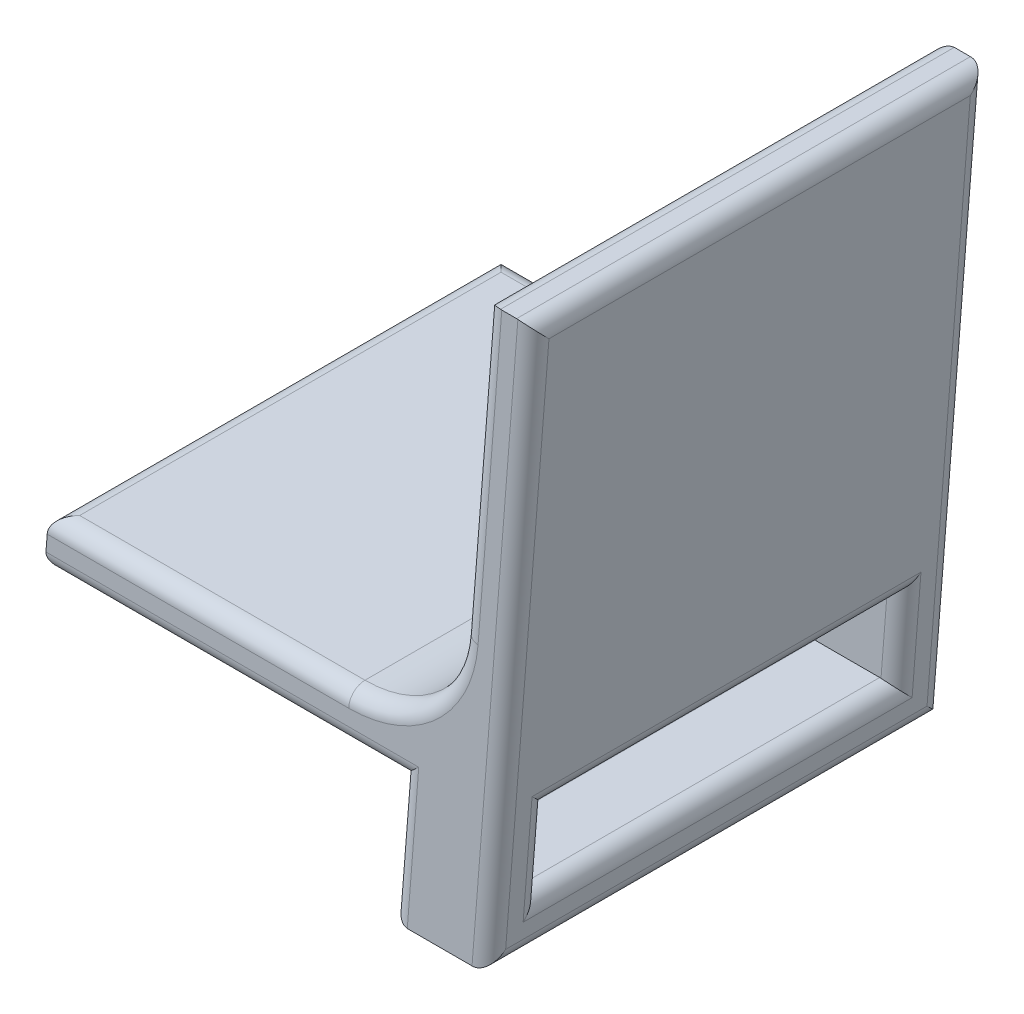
ISO-10303-21;
HEADER;
FILE_DESCRIPTION(('STEP AP214'),'2;1');
FILE_NAME('part.step','',(''),(''),'','','');
FILE_SCHEMA(('AUTOMOTIVE_DESIGN { 1 0 10303 214 1 1 1 1 }'));
ENDSEC;
DATA;
#1=APPLICATION_CONTEXT('core data for automotive mechanical design processes');
#2=APPLICATION_PROTOCOL_DEFINITION('international standard','automotive_design',2000,#1);
#3=PRODUCT_CONTEXT('',#1,'mechanical');
#4=PRODUCT('Part','Part','',(#3));
#5=PRODUCT_RELATED_PRODUCT_CATEGORY('part','',(#4));
#6=PRODUCT_DEFINITION_FORMATION('','',#4);
#7=PRODUCT_DEFINITION_CONTEXT('part definition',#1,'design');
#8=PRODUCT_DEFINITION('design','',#6,#7);
#9=PRODUCT_DEFINITION_SHAPE('','',#8);
#10=(LENGTH_UNIT() NAMED_UNIT(*) SI_UNIT(.MILLI.,.METRE.));
#11=(NAMED_UNIT(*) PLANE_ANGLE_UNIT() SI_UNIT($,.RADIAN.));
#12=(NAMED_UNIT(*) SI_UNIT($,.STERADIAN.) SOLID_ANGLE_UNIT());
#13=UNCERTAINTY_MEASURE_WITH_UNIT(LENGTH_MEASURE(1.E-05),#10,'distance_accuracy_value','');
#14=(GEOMETRIC_REPRESENTATION_CONTEXT(3) GLOBAL_UNCERTAINTY_ASSIGNED_CONTEXT((#13)) GLOBAL_UNIT_ASSIGNED_CONTEXT((#10,
#11,#12)) REPRESENTATION_CONTEXT('',''));
#15=CARTESIAN_POINT('',(0.,0.,0.));
#16=DIRECTION('',(0.,0.,1.));
#17=DIRECTION('',(1.,0.,0.));
#18=AXIS2_PLACEMENT_3D('',#15,#16,#17);
#19=CARTESIAN_POINT('',(1.96754267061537,25.,28.));
#20=DIRECTION('',(0.996917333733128,-0.0784590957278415,0.));
#21=DIRECTION('',(0.0784590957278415,0.996917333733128,0.));
#22=AXIS2_PLACEMENT_3D('',#19,#20,#21);
#23=PLANE('',#22);
#24=DIRECTION('',(0.,0.,-1.));
#25=VECTOR('',#24,1.);
#26=CARTESIAN_POINT('',(0.507687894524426,6.45078632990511,28.));
#27=LINE('',#26,#25);
#28=CARTESIAN_POINT('',(0.507687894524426,6.45078632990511,1.));
#29=VERTEX_POINT('',#28);
#30=CARTESIAN_POINT('',(0.507687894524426,6.45078632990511,27.));
#31=VERTEX_POINT('',#30);
#32=EDGE_CURVE('E523',#29,#31,#27,.F.);
#33=ORIENTED_EDGE('',*,*,#32,.T.);
#34=DIRECTION('',(-0.0784590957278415,-0.996917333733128,0.));
#35=VECTOR('',#34,1.);
#36=CARTESIAN_POINT('',(1.96754267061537,25.,27.));
#37=LINE('',#36,#35);
#38=CARTESIAN_POINT('',(1.89501582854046,24.0784590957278,27.));
#39=VERTEX_POINT('',#38);
#40=EDGE_CURVE('E544',#31,#39,#37,.F.);
#41=ORIENTED_EDGE('',*,*,#40,.T.);
#42=DIRECTION('',(0.,0.,-1.));
#43=VECTOR('',#42,1.);
#44=CARTESIAN_POINT('',(1.89501582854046,24.0784590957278,28.));
#45=LINE('',#44,#43);
#46=CARTESIAN_POINT('',(1.89501582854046,24.0784590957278,1.));
#47=VERTEX_POINT('',#46);
#48=EDGE_CURVE('E540',#39,#47,#45,.T.);
#49=ORIENTED_EDGE('',*,*,#48,.T.);
#50=DIRECTION('',(-0.0784590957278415,-0.996917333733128,0.));
#51=VECTOR('',#50,1.);
#52=CARTESIAN_POINT('',(0.507687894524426,6.45078632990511,1.));
#53=LINE('',#52,#51);
#54=EDGE_CURVE('E542',#47,#29,#53,.T.);
#55=ORIENTED_EDGE('',*,*,#54,.T.);
#56=EDGE_LOOP('',(#33,#41,#49,#55));
#57=FACE_BOUND('',#56,.T.);
#58=ADVANCED_FACE('F32',(#57),#23,.F.);
#59=CARTESIAN_POINT('',(0.,0.,28.));
#60=DIRECTION('',(0.,-1.,0.));
#61=DIRECTION('',(1.,0.,0.));
#62=AXIS2_PLACEMENT_3D('',#59,#60,#61);
#63=PLANE('',#62);
#64=DIRECTION('',(0.,0.,-1.));
#65=VECTOR('',#64,1.);
#66=CARTESIAN_POINT('',(-24.0756095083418,0.,28.));
#67=LINE('',#66,#65);
#68=CARTESIAN_POINT('',(-24.0756095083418,0.,1.));
#69=VERTEX_POINT('',#68);
#70=CARTESIAN_POINT('',(-24.0756095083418,0.,27.));
#71=VERTEX_POINT('',#70);
#72=EDGE_CURVE('E293',#69,#71,#67,.F.);
#73=ORIENTED_EDGE('',*,*,#72,.T.);
#74=DIRECTION('',(-1.,0.,0.));
#75=VECTOR('',#74,1.);
#76=CARTESIAN_POINT('',(0.,0.,27.));
#77=LINE('',#76,#75);
#78=CARTESIAN_POINT('',(-6.47073344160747,0.,27.));
#79=VERTEX_POINT('',#78);
#80=EDGE_CURVE('E302',#71,#79,#77,.F.);
#81=ORIENTED_EDGE('',*,*,#80,.T.);
#82=DIRECTION('',(0.,0.,-1.));
#83=VECTOR('',#82,1.);
#84=CARTESIAN_POINT('',(-6.47073344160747,0.,0.));
#85=LINE('',#84,#83);
#86=CARTESIAN_POINT('',(-6.47073344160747,0.,1.));
#87=VERTEX_POINT('',#86);
#88=EDGE_CURVE('E520',#79,#87,#85,.T.);
#89=ORIENTED_EDGE('',*,*,#88,.T.);
#90=DIRECTION('',(-1.,0.,0.));
#91=VECTOR('',#90,1.);
#92=CARTESIAN_POINT('',(-25.,0.,1.));
#93=LINE('',#92,#91);
#94=EDGE_CURVE('E300',#87,#69,#93,.T.);
#95=ORIENTED_EDGE('',*,*,#94,.T.);
#96=EDGE_LOOP('',(#73,#81,#89,#95));
#97=FACE_BOUND('',#96,.T.);
#98=ADVANCED_FACE('F566',(#97),#63,.F.);
#99=CARTESIAN_POINT('',(-25.,0.,28.));
#100=DIRECTION('',(0.996917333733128,-0.0784590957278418,0.));
#101=DIRECTION('',(0.0784590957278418,0.996917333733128,0.));
#102=AXIS2_PLACEMENT_3D('',#99,#100,#101);
#103=PLANE('',#102);
#104=DIRECTION('',(-0.0784590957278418,-0.996917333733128,0.));
#105=VECTOR('',#104,1.);
#106=CARTESIAN_POINT('',(-25.,0.,0.));
#107=LINE('',#106,#105);
#108=CARTESIAN_POINT('',(-25.0787017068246,-1.,0.));
#109=VERTEX_POINT('',#108);
#110=CARTESIAN_POINT('',(-25.1505007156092,-1.91229290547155,0.));
#111=VERTEX_POINT('',#110);
#112=EDGE_CURVE('E509',#109,#111,#107,.T.);
#113=ORIENTED_EDGE('',*,*,#112,.T.);
#114=DIRECTION('',(0.,0.,-1.));
#115=VECTOR('',#114,1.);
#116=CARTESIAN_POINT('',(-25.1505007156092,-1.91229290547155,28.));
#117=LINE('',#116,#115);
#118=CARTESIAN_POINT('',(-25.1505007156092,-1.91229290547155,28.));
#119=VERTEX_POINT('',#118);
#120=EDGE_CURVE('E282',#111,#119,#117,.F.);
#121=ORIENTED_EDGE('',*,*,#120,.T.);
#122=DIRECTION('',(-0.0784590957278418,-0.996917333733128,0.));
#123=VECTOR('',#122,1.);
#124=CARTESIAN_POINT('',(-25.,0.,28.));
#125=LINE('',#124,#123);
#126=CARTESIAN_POINT('',(-25.0787017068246,-1.,28.));
#127=VERTEX_POINT('',#126);
#128=EDGE_CURVE('E265',#127,#119,#125,.T.);
#129=ORIENTED_EDGE('',*,*,#128,.F.);
#130=CARTESIAN_POINT('',(-25.0787017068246,-1.,27.));
#131=DIRECTION('',(0.996917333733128,-0.0784590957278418,0.));
#132=DIRECTION('',(-0.0784590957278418,-0.996917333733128,0.));
#133=AXIS2_PLACEMENT_3D('',#130,#131,#132);
#134=ELLIPSE('',#133,1.00309219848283,1.);
#135=CARTESIAN_POINT('',(-25.0725268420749,-0.921540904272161,27.9969173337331));
#136=VERTEX_POINT('',#135);
#137=EDGE_CURVE('E279',#127,#136,#134,.F.);
#138=ORIENTED_EDGE('',*,*,#137,.T.);
#139=DIRECTION('',(0.,0.,-1.));
#140=VECTOR('',#139,1.);
#141=CARTESIAN_POINT('',(-25.0725268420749,-0.921540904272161,28.));
#142=LINE('',#141,#140);
#143=CARTESIAN_POINT('',(-25.0725268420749,-0.921540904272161,0.00308266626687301));
#144=VERTEX_POINT('',#143);
#145=EDGE_CURVE('E295',#136,#144,#142,.T.);
#146=ORIENTED_EDGE('',*,*,#145,.T.);
#147=CARTESIAN_POINT('',(-25.0787017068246,-1.,1.));
#148=DIRECTION('',(0.996917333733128,-0.0784590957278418,0.));
#149=DIRECTION('',(0.0784590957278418,0.996917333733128,0.));
#150=AXIS2_PLACEMENT_3D('',#147,#148,#149);
#151=ELLIPSE('',#150,1.00309219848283,1.);
#152=EDGE_CURVE('E291',#144,#109,#151,.F.);
#153=ORIENTED_EDGE('',*,*,#152,.T.);
#154=EDGE_LOOP('',(#113,#121,#129,#138,#146,#153));
#155=FACE_BOUND('',#154,.T.);
#156=ADVANCED_FACE('F278',(#155),#103,.F.);
#157=CARTESIAN_POINT('',(-25.2353772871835,-2.99075200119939,28.));
#158=DIRECTION('',(0.,1.,0.));
#159=DIRECTION('',(-1.,0.,0.));
#160=AXIS2_PLACEMENT_3D('',#157,#158,#159);
#161=PLANE('',#160);
#162=CARTESIAN_POINT('',(1.76153051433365,-2.99075200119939,2.));
#163=DIRECTION('',(0.,1.,0.));
#164=DIRECTION('',(1.,0.,0.));
#165=AXIS2_PLACEMENT_3D('',#162,#163,#164);
#166=ELLIPSE('',#165,1.00309219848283,1.);
#167=CARTESIAN_POINT('',(1.76153051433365,-2.99075200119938,3.));
#168=VERTEX_POINT('',#167);
#169=CARTESIAN_POINT('',(1.84023222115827,-2.99075200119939,2.99691733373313));
#170=VERTEX_POINT('',#169);
#171=EDGE_CURVE('E445',#168,#170,#166,.T.);
#172=ORIENTED_EDGE('',*,*,#171,.T.);
#173=DIRECTION('',(0.,0.,1.));
#174=VECTOR('',#173,1.);
#175=CARTESIAN_POINT('',(1.84023222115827,-2.99075200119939,28.));
#176=LINE('',#175,#174);
#177=CARTESIAN_POINT('',(1.84023222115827,-2.99075200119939,25.0030826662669));
#178=VERTEX_POINT('',#177);
#179=EDGE_CURVE('E48',#170,#178,#176,.T.);
#180=ORIENTED_EDGE('',*,*,#179,.T.);
#181=CARTESIAN_POINT('',(1.76153051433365,-2.99075200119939,26.));
#182=DIRECTION('',(0.,1.,0.));
#183=DIRECTION('',(-1.,0.,0.));
#184=AXIS2_PLACEMENT_3D('',#181,#182,#183);
#185=ELLIPSE('',#184,1.00309219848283,1.);
#186=CARTESIAN_POINT('',(1.76153051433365,-2.99075200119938,25.));
#187=VERTEX_POINT('',#186);
#188=EDGE_CURVE('E11',#178,#187,#185,.T.);
#189=ORIENTED_EDGE('',*,*,#188,.T.);
#190=DIRECTION('',(1.,0.,0.));
#191=VECTOR('',#190,1.);
#192=CARTESIAN_POINT('',(-25.2353772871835,-2.99075200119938,25.));
#193=LINE('',#192,#191);
#194=CARTESIAN_POINT('',(-2.2322850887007,-2.99075200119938,25.));
#195=VERTEX_POINT('',#194);
#196=EDGE_CURVE('E512',#195,#187,#193,.T.);
#197=ORIENTED_EDGE('',*,*,#196,.F.);
#198=CARTESIAN_POINT('',(-2.2322850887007,-2.99075200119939,26.));
#199=DIRECTION('',(0.,1.,0.));
#200=DIRECTION('',(-1.,0.,0.));
#201=AXIS2_PLACEMENT_3D('',#198,#199,#200);
#202=ELLIPSE('',#201,1.00309219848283,1.);
#203=CARTESIAN_POINT('',(-3.23537728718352,-2.99075200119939,26.));
#204=VERTEX_POINT('',#203);
#205=EDGE_CURVE('E443',#195,#204,#202,.T.);
#206=ORIENTED_EDGE('',*,*,#205,.T.);
#207=DIRECTION('',(0.,0.,-1.));
#208=VECTOR('',#207,1.);
#209=CARTESIAN_POINT('',(-3.23537728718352,-2.99075200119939,28.));
#210=LINE('',#209,#208);
#211=CARTESIAN_POINT('',(-3.23537728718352,-2.99075200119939,27.));
#212=VERTEX_POINT('',#211);
#213=EDGE_CURVE('E517',#212,#204,#210,.T.);
#214=ORIENTED_EDGE('',*,*,#213,.F.);
#215=DIRECTION('',(1.,0.,0.));
#216=VECTOR('',#215,1.);
#217=CARTESIAN_POINT('',(-25.2353772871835,-2.99075200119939,27.));
#218=LINE('',#217,#216);
#219=CARTESIAN_POINT('',(-24.1535833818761,-2.99075200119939,27.));
#220=VERTEX_POINT('',#219);
#221=EDGE_CURVE('E330',#212,#220,#218,.F.);
#222=ORIENTED_EDGE('',*,*,#221,.T.);
#223=DIRECTION('',(0.,0.,-1.));
#224=VECTOR('',#223,1.);
#225=CARTESIAN_POINT('',(-24.1535833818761,-2.99075200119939,28.));
#226=LINE('',#225,#224);
#227=CARTESIAN_POINT('',(-24.1535833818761,-2.99075200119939,1.));
#228=VERTEX_POINT('',#227);
#229=EDGE_CURVE('E328',#220,#228,#226,.T.);
#230=ORIENTED_EDGE('',*,*,#229,.T.);
#231=DIRECTION('',(1.,0.,0.));
#232=VECTOR('',#231,1.);
#233=CARTESIAN_POINT('',(-3.23537728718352,-2.99075200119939,1.));
#234=LINE('',#233,#232);
#235=CARTESIAN_POINT('',(-3.23537728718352,-2.99075200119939,1.));
#236=VERTEX_POINT('',#235);
#237=EDGE_CURVE('E332',#228,#236,#234,.T.);
#238=ORIENTED_EDGE('',*,*,#237,.T.);
#239=CARTESIAN_POINT('',(-3.23537728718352,-2.99075200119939,2.));
#240=VERTEX_POINT('',#239);
#241=EDGE_CURVE('E508',#240,#236,#210,.T.);
#242=ORIENTED_EDGE('',*,*,#241,.F.);
#243=CARTESIAN_POINT('',(-2.2322850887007,-2.99075200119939,2.));
#244=DIRECTION('',(0.,1.,0.));
#245=DIRECTION('',(1.,0.,0.));
#246=AXIS2_PLACEMENT_3D('',#243,#244,#245);
#247=ELLIPSE('',#246,1.00309219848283,1.);
#248=CARTESIAN_POINT('',(-2.2322850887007,-2.99075200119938,3.));
#249=VERTEX_POINT('',#248);
#250=EDGE_CURVE('E436',#240,#249,#247,.T.);
#251=ORIENTED_EDGE('',*,*,#250,.T.);
#252=DIRECTION('',(1.,0.,0.));
#253=VECTOR('',#252,1.);
#254=CARTESIAN_POINT('',(-25.2353772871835,-2.99075200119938,3.));
#255=LINE('',#254,#253);
#256=EDGE_CURVE('E485',#249,#168,#255,.T.);
#257=ORIENTED_EDGE('',*,*,#256,.T.);
#258=EDGE_LOOP('',(#172,#180,#189,#197,#206,#214,#222,#230,#238,#242,#251,#257));
#259=FACE_BOUND('',#258,.T.);
#260=ADVANCED_FACE('F483',(#259),#161,.F.);
#261=CARTESIAN_POINT('',(-3.86305005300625,-10.9660906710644,28.));
#262=DIRECTION('',(0.996917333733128,-0.0784590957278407,0.));
#263=DIRECTION('',(0.0784590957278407,0.996917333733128,0.));
#264=AXIS2_PLACEMENT_3D('',#261,#262,#263);
#265=PLANE('',#264);
#266=DIRECTION('',(0.,0.,-1.));
#267=VECTOR('',#266,1.);
#268=CARTESIAN_POINT('',(-3.70019960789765,-8.89687957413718,28.));
#269=LINE('',#268,#267);
#270=CARTESIAN_POINT('',(-3.70019960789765,-8.89687957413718,26.));
#271=VERTEX_POINT('',#270);
#272=CARTESIAN_POINT('',(-3.70019960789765,-8.89687957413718,2.));
#273=VERTEX_POINT('',#272);
#274=EDGE_CURVE('E358',#271,#273,#269,.T.);
#275=ORIENTED_EDGE('',*,*,#274,.T.);
#276=DIRECTION('',(0.0784590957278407,0.996917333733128,0.));
#277=VECTOR('',#276,1.);
#278=CARTESIAN_POINT('',(-3.86305005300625,-10.9660906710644,2.));
#279=LINE('',#278,#277);
#280=EDGE_CURVE('E411',#273,#240,#279,.T.);
#281=ORIENTED_EDGE('',*,*,#280,.T.);
#282=ORIENTED_EDGE('',*,*,#241,.T.);
#283=DIRECTION('',(-0.0784590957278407,-0.996917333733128,0.));
#284=VECTOR('',#283,1.);
#285=CARTESIAN_POINT('',(-3.86305005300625,-10.9660906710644,1.));
#286=LINE('',#285,#284);
#287=CARTESIAN_POINT('',(-3.77817348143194,-9.88763157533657,1.));
#288=VERTEX_POINT('',#287);
#289=EDGE_CURVE('E339',#236,#288,#286,.T.);
#290=ORIENTED_EDGE('',*,*,#289,.T.);
#291=DIRECTION('',(0.,0.,-1.));
#292=VECTOR('',#291,1.);
#293=CARTESIAN_POINT('',(-3.77817348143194,-9.88763157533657,28.));
#294=LINE('',#293,#292);
#295=CARTESIAN_POINT('',(-3.77817348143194,-9.88763157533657,27.));
#296=VERTEX_POINT('',#295);
#297=EDGE_CURVE('E335',#288,#296,#294,.F.);
#298=ORIENTED_EDGE('',*,*,#297,.T.);
#299=DIRECTION('',(-0.0784590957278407,-0.996917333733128,0.));
#300=VECTOR('',#299,1.);
#301=CARTESIAN_POINT('',(-3.86305005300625,-10.9660906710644,27.));
#302=LINE('',#301,#300);
#303=EDGE_CURVE('E337',#296,#212,#302,.F.);
#304=ORIENTED_EDGE('',*,*,#303,.T.);
#305=ORIENTED_EDGE('',*,*,#213,.T.);
#306=DIRECTION('',(-0.0784590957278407,-0.996917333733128,0.));
#307=VECTOR('',#306,1.);
#308=CARTESIAN_POINT('',(-3.86305005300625,-10.9660906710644,26.));
#309=LINE('',#308,#307);
#310=EDGE_CURVE('E409',#204,#271,#309,.T.);
#311=ORIENTED_EDGE('',*,*,#310,.T.);
#312=EDGE_LOOP('',(#275,#281,#282,#290,#298,#304,#305,#311));
#313=FACE_BOUND('',#312,.T.);
#314=ADVANCED_FACE('F865',(#313),#265,.F.);
#315=CARTESIAN_POINT('',(2.13694994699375,-10.9660906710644,28.));
#316=DIRECTION('',(0.,1.,0.));
#317=DIRECTION('',(0.,0.,1.));
#318=AXIS2_PLACEMENT_3D('',#315,#316,#317);
#319=PLANE('',#318);
#320=DIRECTION('',(1.,0.,0.));
#321=VECTOR('',#320,1.);
#322=CARTESIAN_POINT('',(2.13694994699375,-10.9660906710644,0.));
#323=LINE('',#322,#321);
#324=CARTESIAN_POINT('',(-2.78125614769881,-10.9660906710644,0.));
#325=VERTEX_POINT('',#324);
#326=CARTESIAN_POINT('',(1.13385774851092,-10.9660906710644,0.));
#327=VERTEX_POINT('',#326);
#328=EDGE_CURVE('E511',#325,#327,#323,.T.);
#329=ORIENTED_EDGE('',*,*,#328,.T.);
#330=CARTESIAN_POINT('',(1.13385774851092,-10.9660906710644,1.));
#331=DIRECTION('',(0.,1.,0.));
#332=DIRECTION('',(-1.,0.,0.));
#333=AXIS2_PLACEMENT_3D('',#330,#331,#332);
#334=ELLIPSE('',#333,1.00309219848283,1.);
#335=CARTESIAN_POINT('',(1.21255945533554,-10.9660906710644,0.00308266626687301));
#336=VERTEX_POINT('',#335);
#337=EDGE_CURVE('E356',#327,#336,#334,.F.);
#338=ORIENTED_EDGE('',*,*,#337,.T.);
#339=DIRECTION('',(0.,0.,-1.));
#340=VECTOR('',#339,1.);
#341=CARTESIAN_POINT('',(1.21255945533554,-10.9660906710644,28.));
#342=LINE('',#341,#340);
#343=CARTESIAN_POINT('',(1.21255945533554,-10.9660906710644,27.9969173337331));
#344=VERTEX_POINT('',#343);
#345=EDGE_CURVE('E352',#336,#344,#342,.F.);
#346=ORIENTED_EDGE('',*,*,#345,.T.);
#347=CARTESIAN_POINT('',(1.13385774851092,-10.9660906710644,27.));
#348=DIRECTION('',(0.,1.,0.));
#349=DIRECTION('',(1.,0.,0.));
#350=AXIS2_PLACEMENT_3D('',#347,#348,#349);
#351=ELLIPSE('',#350,1.00309219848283,1.);
#352=CARTESIAN_POINT('',(1.13385774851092,-10.9660906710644,28.));
#353=VERTEX_POINT('',#352);
#354=EDGE_CURVE('E354',#344,#353,#351,.F.);
#355=ORIENTED_EDGE('',*,*,#354,.T.);
#356=DIRECTION('',(1.,0.,0.));
#357=VECTOR('',#356,1.);
#358=CARTESIAN_POINT('',(2.13694994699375,-10.9660906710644,28.));
#359=LINE('',#358,#357);
#360=CARTESIAN_POINT('',(-2.78125614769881,-10.9660906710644,28.));
#361=VERTEX_POINT('',#360);
#362=EDGE_CURVE('E283',#361,#353,#359,.T.);
#363=ORIENTED_EDGE('',*,*,#362,.F.);
#364=DIRECTION('',(0.,0.,-1.));
#365=VECTOR('',#364,1.);
#366=CARTESIAN_POINT('',(-2.78125614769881,-10.9660906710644,28.));
#367=LINE('',#366,#365);
#368=EDGE_CURVE('E350',#361,#325,#367,.T.);
#369=ORIENTED_EDGE('',*,*,#368,.T.);
#370=EDGE_LOOP('',(#329,#338,#346,#355,#363,#369));
#371=FACE_BOUND('',#370,.T.);
#372=ADVANCED_FACE('F599',(#371),#319,.F.);
#373=CARTESIAN_POINT('',(3.,0.,28.));
#374=DIRECTION('',(-0.996917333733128,0.0784590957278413,0.));
#375=DIRECTION('',(-0.0784590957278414,-0.996917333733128,0.));
#376=AXIS2_PLACEMENT_3D('',#373,#374,#375);
#377=PLANE('',#376);
#378=DIRECTION('',(0.,0.,1.));
#379=VECTOR('',#378,1.);
#380=CARTESIAN_POINT('',(2.8371495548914,-2.06921109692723,28.));
#381=LINE('',#380,#379);
#382=CARTESIAN_POINT('',(2.8371495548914,-2.06921109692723,26.));
#383=VERTEX_POINT('',#382);
#384=CARTESIAN_POINT('',(2.8371495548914,-2.06921109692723,2.));
#385=VERTEX_POINT('',#384);
#386=EDGE_CURVE('E426',#383,#385,#381,.F.);
#387=ORIENTED_EDGE('',*,*,#386,.T.);
#388=DIRECTION('',(0.0784590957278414,0.996917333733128,0.));
#389=VECTOR('',#388,1.);
#390=CARTESIAN_POINT('',(3.,0.,2.));
#391=LINE('',#390,#389);
#392=CARTESIAN_POINT('',(2.28745066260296,-9.05379776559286,2.));
#393=VERTEX_POINT('',#392);
#394=EDGE_CURVE('E432',#385,#393,#391,.F.);
#395=ORIENTED_EDGE('',*,*,#394,.T.);
#396=DIRECTION('',(0.,0.,-1.));
#397=VECTOR('',#396,1.);
#398=CARTESIAN_POINT('',(2.28745066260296,-9.05379776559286,28.));
#399=LINE('',#398,#397);
#400=CARTESIAN_POINT('',(2.28745066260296,-9.05379776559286,26.));
#401=VERTEX_POINT('',#400);
#402=EDGE_CURVE('E430',#393,#401,#399,.F.);
#403=ORIENTED_EDGE('',*,*,#402,.T.);
#404=DIRECTION('',(-0.0784590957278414,-0.996917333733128,0.));
#405=VECTOR('',#404,1.);
#406=CARTESIAN_POINT('',(3.,0.,26.));
#407=LINE('',#406,#405);
#408=EDGE_CURVE('E428',#401,#383,#407,.F.);
#409=ORIENTED_EDGE('',*,*,#408,.T.);
#410=EDGE_LOOP('',(#387,#395,#403,#409));
#411=FACE_BOUND('',#410,.T.);
#412=DIRECTION('',(0.0784590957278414,0.996917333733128,0.));
#413=VECTOR('',#412,1.);
#414=CARTESIAN_POINT('',(4.96754267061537,25.,1.));
#415=LINE('',#414,#413);
#416=CARTESIAN_POINT('',(2.20947678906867,-10.0445497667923,1.));
#417=VERTEX_POINT('',#416);
#418=CARTESIAN_POINT('',(4.88266609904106,23.9215409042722,1.));
#419=VERTEX_POINT('',#418);
#420=EDGE_CURVE('E345',#417,#419,#415,.T.);
#421=ORIENTED_EDGE('',*,*,#420,.T.);
#422=DIRECTION('',(0.,0.,-1.));
#423=VECTOR('',#422,1.);
#424=CARTESIAN_POINT('',(4.88266609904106,23.9215409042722,28.));
#425=LINE('',#424,#423);
#426=CARTESIAN_POINT('',(4.88266609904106,23.9215409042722,27.));
#427=VERTEX_POINT('',#426);
#428=EDGE_CURVE('E348',#419,#427,#425,.F.);
#429=ORIENTED_EDGE('',*,*,#428,.T.);
#430=DIRECTION('',(0.0784590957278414,0.996917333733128,0.));
#431=VECTOR('',#430,1.);
#432=CARTESIAN_POINT('',(3.,0.,27.));
#433=LINE('',#432,#431);
#434=CARTESIAN_POINT('',(2.20947678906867,-10.0445497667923,27.));
#435=VERTEX_POINT('',#434);
#436=EDGE_CURVE('E343',#427,#435,#433,.F.);
#437=ORIENTED_EDGE('',*,*,#436,.T.);
#438=DIRECTION('',(0.,0.,-1.));
#439=VECTOR('',#438,1.);
#440=CARTESIAN_POINT('',(2.20947678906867,-10.0445497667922,28.));
#441=LINE('',#440,#439);
#442=EDGE_CURVE('E341',#435,#417,#441,.T.);
#443=ORIENTED_EDGE('',*,*,#442,.T.);
#444=EDGE_LOOP('',(#421,#429,#437,#443));
#445=FACE_BOUND('',#444,.T.);
#446=ADVANCED_FACE('F475',(#411,#445),#377,.F.);
#447=CARTESIAN_POINT('',(4.96754267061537,25.,28.));
#448=DIRECTION('',(0.,-1.,0.));
#449=DIRECTION('',(0.,0.,-1.));
#450=AXIS2_PLACEMENT_3D('',#447,#448,#449);
#451=PLANE('',#450);
#452=DIRECTION('',(0.,0.,-1.));
#453=VECTOR('',#452,1.);
#454=CARTESIAN_POINT('',(2.89193316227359,25.,28.));
#455=LINE('',#454,#453);
#456=CARTESIAN_POINT('',(2.89193316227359,25.,0.00308266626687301));
#457=VERTEX_POINT('',#456);
#458=CARTESIAN_POINT('',(2.89193316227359,25.,27.9969173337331));
#459=VERTEX_POINT('',#458);
#460=EDGE_CURVE('E549',#457,#459,#455,.F.);
#461=ORIENTED_EDGE('',*,*,#460,.T.);
#462=CARTESIAN_POINT('',(2.9706348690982,25.,27.));
#463=DIRECTION('',(0.,-1.,0.));
#464=DIRECTION('',(-1.,0.,0.));
#465=AXIS2_PLACEMENT_3D('',#462,#463,#464);
#466=ELLIPSE('',#465,1.00309219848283,1.);
#467=CARTESIAN_POINT('',(2.9706348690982,25.,28.));
#468=VERTEX_POINT('',#467);
#469=EDGE_CURVE('E553',#459,#468,#466,.F.);
#470=ORIENTED_EDGE('',*,*,#469,.T.);
#471=DIRECTION('',(-1.,0.,0.));
#472=VECTOR('',#471,1.);
#473=CARTESIAN_POINT('',(4.96754267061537,25.,28.));
#474=LINE('',#473,#472);
#475=CARTESIAN_POINT('',(3.88574876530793,25.,28.));
#476=VERTEX_POINT('',#475);
#477=EDGE_CURVE('E506',#476,#468,#474,.T.);
#478=ORIENTED_EDGE('',*,*,#477,.F.);
#479=DIRECTION('',(0.,0.,-1.));
#480=VECTOR('',#479,1.);
#481=CARTESIAN_POINT('',(3.88574876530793,25.,28.));
#482=LINE('',#481,#480);
#483=CARTESIAN_POINT('',(3.88574876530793,25.,0.));
#484=VERTEX_POINT('',#483);
#485=EDGE_CURVE('E547',#476,#484,#482,.T.);
#486=ORIENTED_EDGE('',*,*,#485,.T.);
#487=DIRECTION('',(-1.,0.,0.));
#488=VECTOR('',#487,1.);
#489=CARTESIAN_POINT('',(4.96754267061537,25.,0.));
#490=LINE('',#489,#488);
#491=CARTESIAN_POINT('',(2.9706348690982,25.,0.));
#492=VERTEX_POINT('',#491);
#493=EDGE_CURVE('E284',#484,#492,#490,.T.);
#494=ORIENTED_EDGE('',*,*,#493,.T.);
#495=CARTESIAN_POINT('',(2.9706348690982,25.,1.));
#496=DIRECTION('',(0.,-1.,0.));
#497=DIRECTION('',(1.,0.,0.));
#498=AXIS2_PLACEMENT_3D('',#495,#496,#497);
#499=ELLIPSE('',#498,1.00309219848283,1.);
#500=EDGE_CURVE('E551',#492,#457,#499,.F.);
#501=ORIENTED_EDGE('',*,*,#500,.T.);
#502=EDGE_LOOP('',(#461,#470,#478,#486,#494,#501));
#503=FACE_BOUND('',#502,.T.);
#504=ADVANCED_FACE('F630',(#503),#451,.F.);
#505=CARTESIAN_POINT('',(0.,0.,28.));
#506=DIRECTION('',(0.,0.,-1.));
#507=DIRECTION('',(-1.,0.,0.));
#508=AXIS2_PLACEMENT_3D('',#505,#506,#507);
#509=PLANE('',#508);
#510=ORIENTED_EDGE('',*,*,#477,.T.);
#511=DIRECTION('',(-0.0784590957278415,-0.996917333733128,0.));
#512=VECTOR('',#511,1.);
#513=CARTESIAN_POINT('',(0.996917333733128,-0.0784590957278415,28.));
#514=LINE('',#513,#512);
#515=CARTESIAN_POINT('',(1.50460522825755,6.37232723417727,28.));
#516=VERTEX_POINT('',#515);
#517=EDGE_CURVE('E274',#468,#516,#514,.T.);
#518=ORIENTED_EDGE('',*,*,#517,.T.);
#519=CARTESIAN_POINT('',(-6.47073344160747,7.,28.));
#520=DIRECTION('',(0.,0.,-1.));
#521=DIRECTION('',(-1.,0.,0.));
#522=AXIS2_PLACEMENT_3D('',#519,#520,#521);
#523=CIRCLE('',#522,8.);
#524=CARTESIAN_POINT('',(-6.47073344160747,-1.,28.));
#525=VERTEX_POINT('',#524);
#526=EDGE_CURVE('E269',#516,#525,#523,.T.);
#527=ORIENTED_EDGE('',*,*,#526,.T.);
#528=DIRECTION('',(-1.,0.,0.));
#529=VECTOR('',#528,1.);
#530=CARTESIAN_POINT('',(0.,-1.,28.));
#531=LINE('',#530,#529);
#532=EDGE_CURVE('E261',#525,#127,#531,.T.);
#533=ORIENTED_EDGE('',*,*,#532,.T.);
#534=ORIENTED_EDGE('',*,*,#128,.T.);
#535=CARTESIAN_POINT('',(-24.1535833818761,-1.99075200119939,28.));
#536=DIRECTION('',(0.,0.,-1.));
#537=DIRECTION('',(-1.,0.,0.));
#538=AXIS2_PLACEMENT_3D('',#535,#536,#537);
#539=CIRCLE('',#538,1.);
#540=CARTESIAN_POINT('',(-25.1535833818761,-1.99075200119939,28.));
#541=VERTEX_POINT('',#540);
#542=EDGE_CURVE('E526',#119,#541,#539,.F.);
#543=ORIENTED_EDGE('',*,*,#542,.T.);
#544=DIRECTION('',(1.,0.,0.));
#545=VECTOR('',#544,1.);
#546=CARTESIAN_POINT('',(0.,-1.99075200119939,28.));
#547=LINE('',#546,#545);
#548=CARTESIAN_POINT('',(-2.15358338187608,-1.99075200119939,28.));
#549=VERTEX_POINT('',#548);
#550=EDGE_CURVE('E528',#541,#549,#547,.T.);
#551=ORIENTED_EDGE('',*,*,#550,.T.);
#552=DIRECTION('',(-0.0784590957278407,-0.996917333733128,0.));
#553=VECTOR('',#552,1.);
#554=CARTESIAN_POINT('',(-1.98461517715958,0.156192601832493,28.));
#555=LINE('',#554,#553);
#556=CARTESIAN_POINT('',(-2.85971524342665,-10.9630080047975,28.));
#557=VERTEX_POINT('',#556);
#558=EDGE_CURVE('E530',#549,#557,#555,.T.);
#559=ORIENTED_EDGE('',*,*,#558,.T.);
#560=CARTESIAN_POINT('',(-2.78125614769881,-9.96609067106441,28.));
#561=DIRECTION('',(0.,0.,-1.));
#562=DIRECTION('',(-1.,0.,0.));
#563=AXIS2_PLACEMENT_3D('',#560,#561,#562);
#564=CIRCLE('',#563,1.);
#565=EDGE_CURVE('E532',#557,#361,#564,.F.);
#566=ORIENTED_EDGE('',*,*,#565,.T.);
#567=ORIENTED_EDGE('',*,*,#362,.T.);
#568=DIRECTION('',(0.0784590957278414,0.996917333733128,0.));
#569=VECTOR('',#568,1.);
#570=CARTESIAN_POINT('',(1.98461517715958,-0.156192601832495,28.));
#571=LINE('',#570,#569);
#572=CARTESIAN_POINT('',(3.96420786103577,24.9969173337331,28.));
#573=VERTEX_POINT('',#572);
#574=EDGE_CURVE('E536',#353,#573,#571,.T.);
#575=ORIENTED_EDGE('',*,*,#574,.T.);
#576=CARTESIAN_POINT('',(3.88574876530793,24.,28.));
#577=DIRECTION('',(0.,0.,-1.));
#578=DIRECTION('',(-1.,0.,0.));
#579=AXIS2_PLACEMENT_3D('',#576,#577,#578);
#580=CIRCLE('',#579,1.);
#581=EDGE_CURVE('E534',#573,#476,#580,.F.);
#582=ORIENTED_EDGE('',*,*,#581,.T.);
#583=EDGE_LOOP('',(#510,#518,#527,#533,#534,#543,#551,#559,#566,#567,#575,#582));
#584=FACE_BOUND('',#583,.T.);
#585=ADVANCED_FACE('F264',(#584),#509,.F.);
#586=CARTESIAN_POINT('',(0.,0.,0.));
#587=DIRECTION('',(0.,0.,-1.));
#588=DIRECTION('',(-1.,0.,0.));
#589=AXIS2_PLACEMENT_3D('',#586,#587,#588);
#590=PLANE('',#589);
#591=CARTESIAN_POINT('',(-6.47073344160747,7.,0.));
#592=DIRECTION('',(0.,0.,-1.));
#593=DIRECTION('',(-1.,0.,0.));
#594=AXIS2_PLACEMENT_3D('',#591,#592,#593);
#595=CIRCLE('',#594,8.);
#596=CARTESIAN_POINT('',(-6.47073344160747,-1.,0.));
#597=VERTEX_POINT('',#596);
#598=CARTESIAN_POINT('',(1.50460522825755,6.37232723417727,0.));
#599=VERTEX_POINT('',#598);
#600=EDGE_CURVE('E320',#597,#599,#595,.F.);
#601=ORIENTED_EDGE('',*,*,#600,.T.);
#602=DIRECTION('',(-0.0784590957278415,-0.996917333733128,0.));
#603=VECTOR('',#602,1.);
#604=CARTESIAN_POINT('',(2.9644600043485,24.9215409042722,0.));
#605=LINE('',#604,#603);
#606=EDGE_CURVE('E322',#599,#492,#605,.F.);
#607=ORIENTED_EDGE('',*,*,#606,.T.);
#608=ORIENTED_EDGE('',*,*,#493,.F.);
#609=CARTESIAN_POINT('',(3.88574876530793,24.,0.));
#610=DIRECTION('',(0.,0.,-1.));
#611=DIRECTION('',(-1.,0.,0.));
#612=AXIS2_PLACEMENT_3D('',#609,#610,#611);
#613=CIRCLE('',#612,1.);
#614=CARTESIAN_POINT('',(3.96420786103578,24.9969173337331,0.));
#615=VERTEX_POINT('',#614);
#616=EDGE_CURVE('E313',#484,#615,#613,.T.);
#617=ORIENTED_EDGE('',*,*,#616,.T.);
#618=DIRECTION('',(0.0784590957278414,0.996917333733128,0.));
#619=VECTOR('',#618,1.);
#620=CARTESIAN_POINT('',(1.14003261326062,-10.8876315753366,0.));
#621=LINE('',#620,#619);
#622=EDGE_CURVE('E315',#615,#327,#621,.F.);
#623=ORIENTED_EDGE('',*,*,#622,.T.);
#624=ORIENTED_EDGE('',*,*,#328,.F.);
#625=CARTESIAN_POINT('',(-2.78125614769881,-9.96609067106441,0.));
#626=DIRECTION('',(0.,0.,-1.));
#627=DIRECTION('',(-1.,0.,0.));
#628=AXIS2_PLACEMENT_3D('',#625,#626,#627);
#629=CIRCLE('',#628,1.);
#630=CARTESIAN_POINT('',(-2.85971524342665,-10.9630080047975,0.));
#631=VERTEX_POINT('',#630);
#632=EDGE_CURVE('E311',#325,#631,#629,.T.);
#633=ORIENTED_EDGE('',*,*,#632,.T.);
#634=DIRECTION('',(-0.0784590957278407,-0.996917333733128,0.));
#635=VECTOR('',#634,1.);
#636=CARTESIAN_POINT('',(-2.2384599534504,-3.06921109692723,0.));
#637=LINE('',#636,#635);
#638=CARTESIAN_POINT('',(-2.15358338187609,-1.99075200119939,0.));
#639=VERTEX_POINT('',#638);
#640=EDGE_CURVE('E309',#631,#639,#637,.F.);
#641=ORIENTED_EDGE('',*,*,#640,.T.);
#642=DIRECTION('',(1.,0.,0.));
#643=VECTOR('',#642,1.);
#644=CARTESIAN_POINT('',(-25.2353772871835,-1.99075200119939,0.));
#645=LINE('',#644,#643);
#646=CARTESIAN_POINT('',(-25.1535833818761,-1.99075200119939,0.));
#647=VERTEX_POINT('',#646);
#648=EDGE_CURVE('E306',#639,#647,#645,.F.);
#649=ORIENTED_EDGE('',*,*,#648,.T.);
#650=CARTESIAN_POINT('',(-24.1535833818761,-1.99075200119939,0.));
#651=DIRECTION('',(0.,0.,-1.));
#652=DIRECTION('',(-1.,0.,0.));
#653=AXIS2_PLACEMENT_3D('',#650,#651,#652);
#654=CIRCLE('',#653,1.);
#655=EDGE_CURVE('E304',#647,#111,#654,.T.);
#656=ORIENTED_EDGE('',*,*,#655,.T.);
#657=ORIENTED_EDGE('',*,*,#112,.F.);
#658=DIRECTION('',(-1.,0.,0.));
#659=VECTOR('',#658,1.);
#660=CARTESIAN_POINT('',(-6.47073344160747,-1.,0.));
#661=LINE('',#660,#659);
#662=EDGE_CURVE('E318',#109,#597,#661,.F.);
#663=ORIENTED_EDGE('',*,*,#662,.T.);
#664=EDGE_LOOP('',(#601,#607,#608,#617,#623,#624,#633,#641,#649,#656,#657,#663));
#665=FACE_BOUND('',#664,.T.);
#666=ADVANCED_FACE('F575',(#665),#590,.T.);
#667=CARTESIAN_POINT('',(-25.6276727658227,-7.97533866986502,25.));
#668=DIRECTION('',(0.,0.,1.));
#669=DIRECTION('',(1.,0.,0.));
#670=AXIS2_PLACEMENT_3D('',#667,#668,#669);
#671=PLANE('',#670);
#672=DIRECTION('',(1.,0.,0.));
#673=VECTOR('',#672,1.);
#674=CARTESIAN_POINT('',(-25.6276727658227,-7.97533866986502,25.));
#675=LINE('',#674,#673);
#676=CARTESIAN_POINT('',(-2.6245805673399,-7.97533866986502,25.));
#677=VERTEX_POINT('',#676);
#678=CARTESIAN_POINT('',(1.29053332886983,-7.97533866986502,25.));
#679=VERTEX_POINT('',#678);
#680=EDGE_CURVE('E379',#677,#679,#675,.T.);
#681=ORIENTED_EDGE('',*,*,#680,.F.);
#682=DIRECTION('',(-0.0784590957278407,-0.996917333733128,0.));
#683=VECTOR('',#682,1.);
#684=CARTESIAN_POINT('',(-2.76618368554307,-9.77457688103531,25.));
#685=LINE('',#684,#683);
#686=EDGE_CURVE('E420',#677,#195,#685,.F.);
#687=ORIENTED_EDGE('',*,*,#686,.T.);
#688=ORIENTED_EDGE('',*,*,#196,.T.);
#689=DIRECTION('',(-0.0784590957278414,-0.996917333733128,0.));
#690=VECTOR('',#689,1.);
#691=CARTESIAN_POINT('',(1.20304666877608,-10.0869620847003,25.));
#692=LINE('',#691,#690);
#693=CARTESIAN_POINT('',(1.36899242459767,-7.9784213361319,25.));
#694=VERTEX_POINT('',#693);
#695=EDGE_CURVE('E56',#187,#694,#692,.T.);
#696=ORIENTED_EDGE('',*,*,#695,.T.);
#697=CARTESIAN_POINT('',(1.29053332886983,-8.97533866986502,25.));
#698=DIRECTION('',(0.,0.,1.));
#699=DIRECTION('',(1.,0.,0.));
#700=AXIS2_PLACEMENT_3D('',#697,#698,#699);
#701=CIRCLE('',#700,1.);
#702=EDGE_CURVE('E41',#694,#679,#701,.T.);
#703=ORIENTED_EDGE('',*,*,#702,.T.);
#704=EDGE_LOOP('',(#681,#687,#688,#696,#703));
#705=FACE_BOUND('',#704,.T.);
#706=ADVANCED_FACE('F828',(#705),#671,.F.);
#707=CARTESIAN_POINT('',(-25.6276727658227,-7.97533866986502,3.));
#708=DIRECTION('',(0.,0.,-1.));
#709=DIRECTION('',(-1.,0.,0.));
#710=AXIS2_PLACEMENT_3D('',#707,#708,#709);
#711=PLANE('',#710);
#712=ORIENTED_EDGE('',*,*,#256,.F.);
#713=DIRECTION('',(0.0784590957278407,0.996917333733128,0.));
#714=VECTOR('',#713,1.);
#715=CARTESIAN_POINT('',(-2.76618368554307,-9.77457688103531,3.));
#716=LINE('',#715,#714);
#717=CARTESIAN_POINT('',(-2.6245805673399,-7.97533866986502,3.));
#718=VERTEX_POINT('',#717);
#719=EDGE_CURVE('E417',#249,#718,#716,.F.);
#720=ORIENTED_EDGE('',*,*,#719,.T.);
#721=DIRECTION('',(1.,0.,0.));
#722=VECTOR('',#721,1.);
#723=CARTESIAN_POINT('',(-25.6276727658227,-7.97533866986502,3.));
#724=LINE('',#723,#722);
#725=CARTESIAN_POINT('',(1.29053332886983,-7.97533866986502,3.));
#726=VERTEX_POINT('',#725);
#727=EDGE_CURVE('E492',#718,#726,#724,.T.);
#728=ORIENTED_EDGE('',*,*,#727,.T.);
#729=CARTESIAN_POINT('',(1.29053332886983,-8.97533866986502,3.));
#730=DIRECTION('',(0.,0.,-1.));
#731=DIRECTION('',(-1.,0.,0.));
#732=AXIS2_PLACEMENT_3D('',#729,#730,#731);
#733=CIRCLE('',#732,1.);
#734=CARTESIAN_POINT('',(1.36899242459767,-7.9784213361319,3.));
#735=VERTEX_POINT('',#734);
#736=EDGE_CURVE('E447',#726,#735,#733,.T.);
#737=ORIENTED_EDGE('',*,*,#736,.T.);
#738=DIRECTION('',(0.0784590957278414,0.996917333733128,0.));
#739=VECTOR('',#738,1.);
#740=CARTESIAN_POINT('',(1.20304666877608,-10.0869620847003,3.));
#741=LINE('',#740,#739);
#742=EDGE_CURVE('E414',#735,#168,#741,.T.);
#743=ORIENTED_EDGE('',*,*,#742,.T.);
#744=EDGE_LOOP('',(#712,#720,#728,#737,#743));
#745=FACE_BOUND('',#744,.T.);
#746=ADVANCED_FACE('F487',(#745),#711,.F.);
#747=CARTESIAN_POINT('',(-25.6276727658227,-7.97533866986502,25.));
#748=DIRECTION('',(0.,-1.,0.));
#749=DIRECTION('',(1.,0.,0.));
#750=AXIS2_PLACEMENT_3D('',#747,#748,#749);
#751=PLANE('',#750);
#752=CARTESIAN_POINT('',(-2.6245805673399,-7.97533866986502,2.));
#753=DIRECTION('',(0.,-1.,0.));
#754=DIRECTION('',(1.,0.,0.));
#755=AXIS2_PLACEMENT_3D('',#752,#753,#754);
#756=ELLIPSE('',#755,1.00309219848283,1.);
#757=CARTESIAN_POINT('',(-2.70328227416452,-7.97533866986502,2.99691733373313));
#758=VERTEX_POINT('',#757);
#759=EDGE_CURVE('E438',#718,#758,#756,.T.);
#760=ORIENTED_EDGE('',*,*,#759,.T.);
#761=DIRECTION('',(0.,0.,-1.));
#762=VECTOR('',#761,1.);
#763=CARTESIAN_POINT('',(-2.70328227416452,-7.97533866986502,25.));
#764=LINE('',#763,#762);
#765=CARTESIAN_POINT('',(-2.70328227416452,-7.97533866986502,25.0030826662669));
#766=VERTEX_POINT('',#765);
#767=EDGE_CURVE('E424',#758,#766,#764,.F.);
#768=ORIENTED_EDGE('',*,*,#767,.T.);
#769=CARTESIAN_POINT('',(-2.6245805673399,-7.97533866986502,26.));
#770=DIRECTION('',(0.,-1.,0.));
#771=DIRECTION('',(-1.,0.,0.));
#772=AXIS2_PLACEMENT_3D('',#769,#770,#771);
#773=ELLIPSE('',#772,1.00309219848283,1.);
#774=EDGE_CURVE('E441',#766,#677,#773,.T.);
#775=ORIENTED_EDGE('',*,*,#774,.T.);
#776=ORIENTED_EDGE('',*,*,#680,.T.);
#777=DIRECTION('',(0.,0.,-1.));
#778=VECTOR('',#777,1.);
#779=CARTESIAN_POINT('',(1.29053332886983,-7.97533866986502,25.));
#780=LINE('',#779,#778);
#781=EDGE_CURVE('E422',#679,#726,#780,.T.);
#782=ORIENTED_EDGE('',*,*,#781,.T.);
#783=ORIENTED_EDGE('',*,*,#727,.F.);
#784=EDGE_LOOP('',(#760,#768,#775,#776,#782,#783));
#785=FACE_BOUND('',#784,.T.);
#786=ADVANCED_FACE('F495',(#785),#751,.F.);
#787=CARTESIAN_POINT('',(-6.47073344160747,7.,28.));
#788=DIRECTION('',(0.,0.,1.));
#789=DIRECTION('',(1.,0.,0.));
#790=AXIS2_PLACEMENT_3D('',#787,#788,#789);
#791=CYLINDRICAL_SURFACE('',#790,7.);
#792=ORIENTED_EDGE('',*,*,#32,.F.);
#793=CARTESIAN_POINT('',(-6.47073344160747,7.,1.));
#794=DIRECTION('',(0.,0.,-1.));
#795=DIRECTION('',(-1.,0.,0.));
#796=AXIS2_PLACEMENT_3D('',#793,#794,#795);
#797=CIRCLE('',#796,7.);
#798=EDGE_CURVE('E326',#29,#87,#797,.T.);
#799=ORIENTED_EDGE('',*,*,#798,.T.);
#800=ORIENTED_EDGE('',*,*,#88,.F.);
#801=CARTESIAN_POINT('',(-6.47073344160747,7.,27.));
#802=DIRECTION('',(0.,0.,-1.));
#803=DIRECTION('',(-1.,0.,0.));
#804=AXIS2_PLACEMENT_3D('',#801,#802,#803);
#805=CIRCLE('',#804,7.);
#806=EDGE_CURVE('E324',#79,#31,#805,.F.);
#807=ORIENTED_EDGE('',*,*,#806,.T.);
#808=EDGE_LOOP('',(#792,#799,#800,#807));
#809=FACE_BOUND('',#808,.T.);
#810=ADVANCED_FACE('F653',(#809),#791,.F.);
#811=CARTESIAN_POINT('',(0.,-1.,1.));
#812=DIRECTION('',(1.,0.,0.));
#813=DIRECTION('',(0.,1.,0.));
#814=AXIS2_PLACEMENT_3D('',#811,#812,#813);
#815=CYLINDRICAL_SURFACE('',#814,1.);
#816=CARTESIAN_POINT('',(-24.0756095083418,-1.,1.));
#817=DIRECTION('',(0.707106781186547,0.,-0.707106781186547));
#818=DIRECTION('',(-0.707106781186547,0.,-0.707106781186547));
#819=AXIS2_PLACEMENT_3D('',#816,#817,#818);
#820=ELLIPSE('',#819,1.41421356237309,1.);
#821=EDGE_CURVE('E373',#69,#144,#820,.F.);
#822=ORIENTED_EDGE('',*,*,#821,.F.);
#823=ORIENTED_EDGE('',*,*,#94,.F.);
#824=CARTESIAN_POINT('',(-6.47073344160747,-1.,1.));
#825=DIRECTION('',(1.,0.,0.));
#826=DIRECTION('',(0.,0.,-1.));
#827=AXIS2_PLACEMENT_3D('',#824,#825,#826);
#828=CIRCLE('',#827,1.);
#829=EDGE_CURVE('E376',#597,#87,#828,.T.);
#830=ORIENTED_EDGE('',*,*,#829,.F.);
#831=ORIENTED_EDGE('',*,*,#662,.F.);
#832=ORIENTED_EDGE('',*,*,#152,.F.);
#833=EDGE_LOOP('',(#822,#823,#830,#831,#832));
#834=FACE_BOUND('',#833,.T.);
#835=ADVANCED_FACE('F560',(#834),#815,.T.);
#836=CARTESIAN_POINT('',(-6.47073344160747,7.,1.));
#837=DIRECTION('',(0.,0.,-1.));
#838=DIRECTION('',(-1.,0.,0.));
#839=AXIS2_PLACEMENT_3D('',#836,#837,#838);
#840=TOROIDAL_SURFACE('',#839,8.,1.);
#841=ORIENTED_EDGE('',*,*,#829,.T.);
#842=ORIENTED_EDGE('',*,*,#798,.F.);
#843=CARTESIAN_POINT('',(1.50460522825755,6.37232723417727,1.));
#844=DIRECTION('',(0.0784590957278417,0.996917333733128,0.));
#845=DIRECTION('',(-0.996917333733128,0.0784590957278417,0.));
#846=AXIS2_PLACEMENT_3D('',#843,#844,#845);
#847=CIRCLE('',#846,1.);
#848=EDGE_CURVE('E370',#599,#29,#847,.T.);
#849=ORIENTED_EDGE('',*,*,#848,.F.);
#850=ORIENTED_EDGE('',*,*,#600,.F.);
#851=EDGE_LOOP('',(#841,#842,#849,#850));
#852=FACE_BOUND('',#851,.T.);
#853=ADVANCED_FACE('F571',(#852),#840,.T.);
#854=CARTESIAN_POINT('',(-24.0756095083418,-1.,28.));
#855=DIRECTION('',(0.,0.,-1.));
#856=DIRECTION('',(-1.,0.,0.));
#857=AXIS2_PLACEMENT_3D('',#854,#855,#856);
#858=CYLINDRICAL_SURFACE('',#857,1.);
#859=ORIENTED_EDGE('',*,*,#821,.T.);
#860=ORIENTED_EDGE('',*,*,#145,.F.);
#861=CARTESIAN_POINT('',(-24.0756095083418,-1.,27.));
#862=DIRECTION('',(-0.707106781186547,0.,-0.707106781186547));
#863=DIRECTION('',(0.707106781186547,0.,-0.707106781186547));
#864=AXIS2_PLACEMENT_3D('',#861,#862,#863);
#865=ELLIPSE('',#864,1.41421356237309,1.);
#866=EDGE_CURVE('E290',#71,#136,#865,.F.);
#867=ORIENTED_EDGE('',*,*,#866,.F.);
#868=ORIENTED_EDGE('',*,*,#72,.F.);
#869=EDGE_LOOP('',(#859,#860,#867,#868));
#870=FACE_BOUND('',#869,.T.);
#871=ADVANCED_FACE('F564',(#870),#858,.T.);
#872=CARTESIAN_POINT('',(2.9644600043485,24.9215409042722,1.));
#873=DIRECTION('',(0.0784590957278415,0.996917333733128,0.));
#874=DIRECTION('',(-0.996917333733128,0.0784590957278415,0.));
#875=AXIS2_PLACEMENT_3D('',#872,#873,#874);
#876=CYLINDRICAL_SURFACE('',#875,1.);
#877=ORIENTED_EDGE('',*,*,#848,.T.);
#878=ORIENTED_EDGE('',*,*,#54,.F.);
#879=CARTESIAN_POINT('',(2.89193316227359,24.,1.00000000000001));
#880=DIRECTION('',(-0.0554789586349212,-0.704927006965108,-0.707106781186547));
#881=DIRECTION('',(0.0554789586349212,0.704927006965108,-0.707106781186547));
#882=AXIS2_PLACEMENT_3D('',#879,#880,#881);
#883=ELLIPSE('',#882,1.41421356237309,1.);
#884=EDGE_CURVE('E366',#457,#47,#883,.F.);
#885=ORIENTED_EDGE('',*,*,#884,.F.);
#886=ORIENTED_EDGE('',*,*,#500,.F.);
#887=ORIENTED_EDGE('',*,*,#606,.F.);
#888=EDGE_LOOP('',(#877,#878,#885,#886,#887));
#889=FACE_BOUND('',#888,.T.);
#890=ADVANCED_FACE('F637',(#889),#876,.T.);
#891=CARTESIAN_POINT('',(0.,-1.,27.));
#892=DIRECTION('',(-1.,0.,0.));
#893=DIRECTION('',(0.,-1.,0.));
#894=AXIS2_PLACEMENT_3D('',#891,#892,#893);
#895=CYLINDRICAL_SURFACE('',#894,1.);
#896=ORIENTED_EDGE('',*,*,#137,.F.);
#897=ORIENTED_EDGE('',*,*,#532,.F.);
#898=CARTESIAN_POINT('',(-6.47073344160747,-1.,27.));
#899=DIRECTION('',(1.,0.,0.));
#900=DIRECTION('',(0.,0.,-1.));
#901=AXIS2_PLACEMENT_3D('',#898,#899,#900);
#902=CIRCLE('',#901,1.);
#903=EDGE_CURVE('E364',#79,#525,#902,.T.);
#904=ORIENTED_EDGE('',*,*,#903,.F.);
#905=ORIENTED_EDGE('',*,*,#80,.F.);
#906=ORIENTED_EDGE('',*,*,#866,.T.);
#907=EDGE_LOOP('',(#896,#897,#904,#905,#906));
#908=FACE_BOUND('',#907,.T.);
#909=ADVANCED_FACE('F287',(#908),#895,.T.);
#910=CARTESIAN_POINT('',(2.89193316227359,24.,28.));
#911=DIRECTION('',(0.,0.,-1.));
#912=DIRECTION('',(-1.,0.,0.));
#913=AXIS2_PLACEMENT_3D('',#910,#911,#912);
#914=CYLINDRICAL_SURFACE('',#913,1.);
#915=ORIENTED_EDGE('',*,*,#884,.T.);
#916=ORIENTED_EDGE('',*,*,#48,.F.);
#917=CARTESIAN_POINT('',(2.89193316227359,24.,27.));
#918=DIRECTION('',(0.0554789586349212,0.704927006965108,-0.707106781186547));
#919=DIRECTION('',(-0.0554789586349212,-0.704927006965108,-0.707106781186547));
#920=AXIS2_PLACEMENT_3D('',#917,#918,#919);
#921=ELLIPSE('',#920,1.41421356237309,1.);
#922=EDGE_CURVE('E361',#459,#39,#921,.F.);
#923=ORIENTED_EDGE('',*,*,#922,.F.);
#924=ORIENTED_EDGE('',*,*,#460,.F.);
#925=EDGE_LOOP('',(#915,#916,#923,#924));
#926=FACE_BOUND('',#925,.T.);
#927=ADVANCED_FACE('F643',(#926),#914,.T.);
#928=CARTESIAN_POINT('',(-6.47073344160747,7.,27.));
#929=DIRECTION('',(0.,0.,-1.));
#930=DIRECTION('',(-1.,0.,0.));
#931=AXIS2_PLACEMENT_3D('',#928,#929,#930);
#932=TOROIDAL_SURFACE('',#931,8.,1.);
#933=ORIENTED_EDGE('',*,*,#903,.T.);
#934=ORIENTED_EDGE('',*,*,#526,.F.);
#935=CARTESIAN_POINT('',(1.50460522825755,6.37232723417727,27.));
#936=DIRECTION('',(0.0784590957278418,0.996917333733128,0.));
#937=DIRECTION('',(-0.996917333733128,0.0784590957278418,0.));
#938=AXIS2_PLACEMENT_3D('',#935,#936,#937);
#939=CIRCLE('',#938,1.);
#940=EDGE_CURVE('E359',#31,#516,#939,.T.);
#941=ORIENTED_EDGE('',*,*,#940,.F.);
#942=ORIENTED_EDGE('',*,*,#806,.F.);
#943=EDGE_LOOP('',(#933,#934,#941,#942));
#944=FACE_BOUND('',#943,.T.);
#945=ADVANCED_FACE('F650',(#944),#932,.T.);
#946=CARTESIAN_POINT('',(0.996917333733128,-0.0784590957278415,27.));
#947=DIRECTION('',(-0.0784590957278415,-0.996917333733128,0.));
#948=DIRECTION('',(0.996917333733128,-0.0784590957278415,0.));
#949=AXIS2_PLACEMENT_3D('',#946,#947,#948);
#950=CYLINDRICAL_SURFACE('',#949,1.);
#951=ORIENTED_EDGE('',*,*,#922,.T.);
#952=ORIENTED_EDGE('',*,*,#40,.F.);
#953=ORIENTED_EDGE('',*,*,#940,.T.);
#954=ORIENTED_EDGE('',*,*,#517,.F.);
#955=ORIENTED_EDGE('',*,*,#469,.F.);
#956=EDGE_LOOP('',(#951,#952,#953,#954,#955));
#957=FACE_BOUND('',#956,.T.);
#958=ADVANCED_FACE('F646',(#957),#950,.T.);
#959=CARTESIAN_POINT('',(-1.98461517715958,0.156192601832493,27.));
#960=DIRECTION('',(-0.0784590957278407,-0.996917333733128,0.));
#961=DIRECTION('',(0.996917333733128,-0.0784590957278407,0.));
#962=AXIS2_PLACEMENT_3D('',#959,#960,#961);
#963=CYLINDRICAL_SURFACE('',#962,1.);
#964=CARTESIAN_POINT('',(-2.78125614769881,-9.96609067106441,27.));
#965=DIRECTION('',(-0.0554789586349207,-0.704927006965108,-0.707106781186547));
#966=DIRECTION('',(0.0554789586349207,0.704927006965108,-0.707106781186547));
#967=AXIS2_PLACEMENT_3D('',#964,#965,#966);
#968=ELLIPSE('',#967,1.41421356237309,1.);
#969=EDGE_CURVE('E392',#557,#296,#968,.T.);
#970=ORIENTED_EDGE('',*,*,#969,.F.);
#971=ORIENTED_EDGE('',*,*,#558,.F.);
#972=CARTESIAN_POINT('',(-2.15358338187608,-1.99075200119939,27.));
#973=DIRECTION('',(0.678800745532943,-0.734322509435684,0.));
#974=DIRECTION('',(-0.734322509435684,-0.678800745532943,0.));
#975=AXIS2_PLACEMENT_3D('',#972,#973,#974);
#976=ELLIPSE('',#975,1.47318636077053,1.);
#977=EDGE_CURVE('E362',#212,#549,#976,.F.);
#978=ORIENTED_EDGE('',*,*,#977,.F.);
#979=ORIENTED_EDGE('',*,*,#303,.F.);
#980=EDGE_LOOP('',(#970,#971,#978,#979));
#981=FACE_BOUND('',#980,.T.);
#982=ADVANCED_FACE('F592',(#981),#963,.T.);
#983=CARTESIAN_POINT('',(0.,-1.99075200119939,27.));
#984=DIRECTION('',(1.,0.,0.));
#985=DIRECTION('',(0.,1.,0.));
#986=AXIS2_PLACEMENT_3D('',#983,#984,#985);
#987=CYLINDRICAL_SURFACE('',#986,1.);
#988=ORIENTED_EDGE('',*,*,#977,.T.);
#989=ORIENTED_EDGE('',*,*,#550,.F.);
#990=CARTESIAN_POINT('',(-24.1535833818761,-1.99075200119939,27.));
#991=DIRECTION('',(-0.707106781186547,0.,-0.707106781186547));
#992=DIRECTION('',(0.707106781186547,0.,-0.707106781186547));
#993=AXIS2_PLACEMENT_3D('',#990,#991,#992);
#994=ELLIPSE('',#993,1.41421356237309,1.);
#995=EDGE_CURVE('E389',#220,#541,#994,.T.);
#996=ORIENTED_EDGE('',*,*,#995,.F.);
#997=ORIENTED_EDGE('',*,*,#221,.F.);
#998=EDGE_LOOP('',(#988,#989,#996,#997));
#999=FACE_BOUND('',#998,.T.);
#1000=ADVANCED_FACE('F586',(#999),#987,.T.);
#1001=CARTESIAN_POINT('',(-2.78125614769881,-9.96609067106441,28.));
#1002=DIRECTION('',(0.,0.,-1.));
#1003=DIRECTION('',(-1.,0.,0.));
#1004=AXIS2_PLACEMENT_3D('',#1001,#1002,#1003);
#1005=CYLINDRICAL_SURFACE('',#1004,1.);
#1006=ORIENTED_EDGE('',*,*,#969,.T.);
#1007=ORIENTED_EDGE('',*,*,#297,.F.);
#1008=CARTESIAN_POINT('',(-2.78125614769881,-9.96609067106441,1.));
#1009=DIRECTION('',(0.0554789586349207,0.704927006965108,-0.707106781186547));
#1010=DIRECTION('',(-0.0554789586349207,-0.704927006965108,-0.707106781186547));
#1011=AXIS2_PLACEMENT_3D('',#1008,#1009,#1010);
#1012=ELLIPSE('',#1011,1.41421356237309,1.);
#1013=EDGE_CURVE('E386',#631,#288,#1012,.T.);
#1014=ORIENTED_EDGE('',*,*,#1013,.F.);
#1015=ORIENTED_EDGE('',*,*,#632,.F.);
#1016=ORIENTED_EDGE('',*,*,#368,.F.);
#1017=ORIENTED_EDGE('',*,*,#565,.F.);
#1018=EDGE_LOOP('',(#1006,#1007,#1014,#1015,#1016,#1017));
#1019=FACE_BOUND('',#1018,.T.);
#1020=ADVANCED_FACE('F603',(#1019),#1005,.T.);
#1021=CARTESIAN_POINT('',(-24.1535833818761,-1.99075200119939,28.));
#1022=DIRECTION('',(0.,0.,-1.));
#1023=DIRECTION('',(-1.,0.,0.));
#1024=AXIS2_PLACEMENT_3D('',#1021,#1022,#1023);
#1025=CYLINDRICAL_SURFACE('',#1024,1.);
#1026=ORIENTED_EDGE('',*,*,#120,.F.);
#1027=ORIENTED_EDGE('',*,*,#655,.F.);
#1028=CARTESIAN_POINT('',(-24.1535833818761,-1.99075200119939,1.));
#1029=DIRECTION('',(0.707106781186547,0.,-0.707106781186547));
#1030=DIRECTION('',(-0.707106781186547,0.,-0.707106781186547));
#1031=AXIS2_PLACEMENT_3D('',#1028,#1029,#1030);
#1032=ELLIPSE('',#1031,1.41421356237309,1.);
#1033=EDGE_CURVE('E383',#228,#647,#1032,.T.);
#1034=ORIENTED_EDGE('',*,*,#1033,.F.);
#1035=ORIENTED_EDGE('',*,*,#229,.F.);
#1036=ORIENTED_EDGE('',*,*,#995,.T.);
#1037=ORIENTED_EDGE('',*,*,#542,.F.);
#1038=EDGE_LOOP('',(#1026,#1027,#1034,#1035,#1036,#1037));
#1039=FACE_BOUND('',#1038,.T.);
#1040=ADVANCED_FACE('F579',(#1039),#1025,.T.);
#1041=CARTESIAN_POINT('',(-2.86613271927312,-11.0445497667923,1.));
#1042=DIRECTION('',(0.0784590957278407,0.996917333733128,0.));
#1043=DIRECTION('',(-0.996917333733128,0.0784590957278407,0.));
#1044=AXIS2_PLACEMENT_3D('',#1041,#1042,#1043);
#1045=CYLINDRICAL_SURFACE('',#1044,1.);
#1046=ORIENTED_EDGE('',*,*,#1013,.T.);
#1047=ORIENTED_EDGE('',*,*,#289,.F.);
#1048=CARTESIAN_POINT('',(-2.15358338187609,-1.99075200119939,1.));
#1049=DIRECTION('',(-0.678800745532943,0.734322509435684,0.));
#1050=DIRECTION('',(-0.734322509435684,-0.678800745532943,0.));
#1051=AXIS2_PLACEMENT_3D('',#1048,#1049,#1050);
#1052=ELLIPSE('',#1051,1.47318636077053,1.);
#1053=EDGE_CURVE('E380',#639,#236,#1052,.T.);
#1054=ORIENTED_EDGE('',*,*,#1053,.F.);
#1055=ORIENTED_EDGE('',*,*,#640,.F.);
#1056=EDGE_LOOP('',(#1046,#1047,#1054,#1055));
#1057=FACE_BOUND('',#1056,.T.);
#1058=ADVANCED_FACE('F684',(#1057),#1045,.T.);
#1059=CARTESIAN_POINT('',(-25.2353772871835,-1.99075200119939,1.));
#1060=DIRECTION('',(-1.,0.,0.));
#1061=DIRECTION('',(0.,-1.,0.));
#1062=AXIS2_PLACEMENT_3D('',#1059,#1060,#1061);
#1063=CYLINDRICAL_SURFACE('',#1062,1.);
#1064=ORIENTED_EDGE('',*,*,#1033,.T.);
#1065=ORIENTED_EDGE('',*,*,#648,.F.);
#1066=ORIENTED_EDGE('',*,*,#1053,.T.);
#1067=ORIENTED_EDGE('',*,*,#237,.F.);
#1068=EDGE_LOOP('',(#1064,#1065,#1066,#1067));
#1069=FACE_BOUND('',#1068,.T.);
#1070=ADVANCED_FACE('F681',(#1069),#1063,.T.);
#1071=CARTESIAN_POINT('',(1.98461517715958,-0.156192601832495,27.));
#1072=DIRECTION('',(0.0784590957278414,0.996917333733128,0.));
#1073=DIRECTION('',(-0.996917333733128,0.0784590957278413,0.));
#1074=AXIS2_PLACEMENT_3D('',#1071,#1072,#1073);
#1075=CYLINDRICAL_SURFACE('',#1074,1.);
#1076=ORIENTED_EDGE('',*,*,#574,.F.);
#1077=ORIENTED_EDGE('',*,*,#354,.F.);
#1078=CARTESIAN_POINT('',(1.21255945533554,-9.96609067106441,27.));
#1079=DIRECTION('',(-0.0554789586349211,-0.704927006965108,-0.707106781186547));
#1080=DIRECTION('',(0.0554789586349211,0.704927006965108,-0.707106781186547));
#1081=AXIS2_PLACEMENT_3D('',#1078,#1079,#1080);
#1082=ELLIPSE('',#1081,1.41421356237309,1.);
#1083=EDGE_CURVE('E384',#435,#344,#1082,.T.);
#1084=ORIENTED_EDGE('',*,*,#1083,.F.);
#1085=ORIENTED_EDGE('',*,*,#436,.F.);
#1086=CARTESIAN_POINT('',(3.88574876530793,24.,27.));
#1087=DIRECTION('',(0.0554789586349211,0.704927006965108,-0.707106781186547));
#1088=DIRECTION('',(-0.0554789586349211,-0.704927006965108,-0.707106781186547));
#1089=AXIS2_PLACEMENT_3D('',#1086,#1087,#1088);
#1090=ELLIPSE('',#1089,1.41421356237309,1.);
#1091=EDGE_CURVE('E403',#573,#427,#1090,.T.);
#1092=ORIENTED_EDGE('',*,*,#1091,.F.);
#1093=EDGE_LOOP('',(#1076,#1077,#1084,#1085,#1092));
#1094=FACE_BOUND('',#1093,.T.);
#1095=ADVANCED_FACE('F623',(#1094),#1075,.T.);
#1096=CARTESIAN_POINT('',(1.21255945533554,-9.96609067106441,28.));
#1097=DIRECTION('',(0.,0.,-1.));
#1098=DIRECTION('',(-1.,0.,0.));
#1099=AXIS2_PLACEMENT_3D('',#1096,#1097,#1098);
#1100=CYLINDRICAL_SURFACE('',#1099,1.);
#1101=ORIENTED_EDGE('',*,*,#1083,.T.);
#1102=ORIENTED_EDGE('',*,*,#345,.F.);
#1103=CARTESIAN_POINT('',(1.21255945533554,-9.96609067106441,1.00000000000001));
#1104=DIRECTION('',(0.0554789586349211,0.704927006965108,-0.707106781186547));
#1105=DIRECTION('',(-0.0554789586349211,-0.704927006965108,-0.707106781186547));
#1106=AXIS2_PLACEMENT_3D('',#1103,#1104,#1105);
#1107=ELLIPSE('',#1106,1.41421356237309,1.);
#1108=EDGE_CURVE('E399',#417,#336,#1107,.T.);
#1109=ORIENTED_EDGE('',*,*,#1108,.F.);
#1110=ORIENTED_EDGE('',*,*,#442,.F.);
#1111=EDGE_LOOP('',(#1101,#1102,#1109,#1110));
#1112=FACE_BOUND('',#1111,.T.);
#1113=ADVANCED_FACE('F613',(#1112),#1100,.T.);
#1114=CARTESIAN_POINT('',(3.88574876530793,24.,28.));
#1115=DIRECTION('',(0.,0.,-1.));
#1116=DIRECTION('',(-1.,0.,0.));
#1117=AXIS2_PLACEMENT_3D('',#1114,#1115,#1116);
#1118=CYLINDRICAL_SURFACE('',#1117,1.);
#1119=ORIENTED_EDGE('',*,*,#1091,.T.);
#1120=ORIENTED_EDGE('',*,*,#428,.F.);
#1121=CARTESIAN_POINT('',(3.88574876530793,24.,1.00000000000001));
#1122=DIRECTION('',(-0.0554789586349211,-0.704927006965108,-0.707106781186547));
#1123=DIRECTION('',(0.0554789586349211,0.704927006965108,-0.707106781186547));
#1124=AXIS2_PLACEMENT_3D('',#1121,#1122,#1123);
#1125=ELLIPSE('',#1124,1.41421356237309,1.);
#1126=EDGE_CURVE('E397',#615,#419,#1125,.T.);
#1127=ORIENTED_EDGE('',*,*,#1126,.F.);
#1128=ORIENTED_EDGE('',*,*,#616,.F.);
#1129=ORIENTED_EDGE('',*,*,#485,.F.);
#1130=ORIENTED_EDGE('',*,*,#581,.F.);
#1131=EDGE_LOOP('',(#1119,#1120,#1127,#1128,#1129,#1130));
#1132=FACE_BOUND('',#1131,.T.);
#1133=ADVANCED_FACE('F633',(#1132),#1118,.T.);
#1134=CARTESIAN_POINT('',(2.00308266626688,0.0784590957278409,1.));
#1135=DIRECTION('',(-0.0784590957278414,-0.996917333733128,0.));
#1136=DIRECTION('',(0.996917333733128,-0.0784590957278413,0.));
#1137=AXIS2_PLACEMENT_3D('',#1134,#1135,#1136);
#1138=CYLINDRICAL_SURFACE('',#1137,1.);
#1139=ORIENTED_EDGE('',*,*,#337,.F.);
#1140=ORIENTED_EDGE('',*,*,#622,.F.);
#1141=ORIENTED_EDGE('',*,*,#1126,.T.);
#1142=ORIENTED_EDGE('',*,*,#420,.F.);
#1143=ORIENTED_EDGE('',*,*,#1108,.T.);
#1144=EDGE_LOOP('',(#1139,#1140,#1141,#1142,#1143));
#1145=FACE_BOUND('',#1144,.T.);
#1146=ADVANCED_FACE('F617',(#1145),#1138,.T.);
#1147=CARTESIAN_POINT('',(-2.86613271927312,-11.0445497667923,26.));
#1148=DIRECTION('',(-0.0784590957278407,-0.996917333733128,0.));
#1149=DIRECTION('',(0.996917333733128,-0.0784590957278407,0.));
#1150=AXIS2_PLACEMENT_3D('',#1147,#1148,#1149);
#1151=CYLINDRICAL_SURFACE('',#1150,1.);
#1152=ORIENTED_EDGE('',*,*,#686,.F.);
#1153=ORIENTED_EDGE('',*,*,#774,.F.);
#1154=CARTESIAN_POINT('',(-2.70328227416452,-8.97533866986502,26.));
#1155=DIRECTION('',(-0.0554789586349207,-0.704927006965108,-0.707106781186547));
#1156=DIRECTION('',(-0.0554789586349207,-0.704927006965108,0.707106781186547));
#1157=AXIS2_PLACEMENT_3D('',#1154,#1155,#1156);
#1158=ELLIPSE('',#1157,1.41421356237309,1.);
#1159=EDGE_CURVE('E400',#271,#766,#1158,.T.);
#1160=ORIENTED_EDGE('',*,*,#1159,.F.);
#1161=ORIENTED_EDGE('',*,*,#310,.F.);
#1162=ORIENTED_EDGE('',*,*,#205,.F.);
#1163=EDGE_LOOP('',(#1152,#1153,#1160,#1161,#1162));
#1164=FACE_BOUND('',#1163,.T.);
#1165=ADVANCED_FACE('F699',(#1164),#1151,.T.);
#1166=CARTESIAN_POINT('',(-2.70328227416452,-8.97533866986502,28.));
#1167=DIRECTION('',(0.,0.,-1.));
#1168=DIRECTION('',(-1.,0.,0.));
#1169=AXIS2_PLACEMENT_3D('',#1166,#1167,#1168);
#1170=CYLINDRICAL_SURFACE('',#1169,1.);
#1171=ORIENTED_EDGE('',*,*,#767,.F.);
#1172=CARTESIAN_POINT('',(-2.70328227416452,-8.97533866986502,2.));
#1173=DIRECTION('',(0.0554789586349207,0.704927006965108,-0.707106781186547));
#1174=DIRECTION('',(0.0554789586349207,0.704927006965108,0.707106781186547));
#1175=AXIS2_PLACEMENT_3D('',#1172,#1173,#1174);
#1176=ELLIPSE('',#1175,1.41421356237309,1.);
#1177=EDGE_CURVE('E451',#273,#758,#1176,.T.);
#1178=ORIENTED_EDGE('',*,*,#1177,.F.);
#1179=ORIENTED_EDGE('',*,*,#274,.F.);
#1180=ORIENTED_EDGE('',*,*,#1159,.T.);
#1181=EDGE_LOOP('',(#1171,#1178,#1179,#1180));
#1182=FACE_BOUND('',#1181,.T.);
#1183=ADVANCED_FACE('F709',(#1182),#1170,.T.);
#1184=CARTESIAN_POINT('',(-2.86613271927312,-11.0445497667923,2.));
#1185=DIRECTION('',(0.0784590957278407,0.996917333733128,0.));
#1186=DIRECTION('',(-0.996917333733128,0.0784590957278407,0.));
#1187=AXIS2_PLACEMENT_3D('',#1184,#1185,#1186);
#1188=CYLINDRICAL_SURFACE('',#1187,1.);
#1189=ORIENTED_EDGE('',*,*,#759,.F.);
#1190=ORIENTED_EDGE('',*,*,#719,.F.);
#1191=ORIENTED_EDGE('',*,*,#250,.F.);
#1192=ORIENTED_EDGE('',*,*,#280,.F.);
#1193=ORIENTED_EDGE('',*,*,#1177,.T.);
#1194=EDGE_LOOP('',(#1189,#1190,#1191,#1192,#1193));
#1195=FACE_BOUND('',#1194,.T.);
#1196=ADVANCED_FACE('F706',(#1195),#1188,.T.);
#1197=CARTESIAN_POINT('',(1.20304666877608,-10.0869620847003,26.));
#1198=DIRECTION('',(-0.0784590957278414,-0.996917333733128,0.));
#1199=DIRECTION('',(0.996917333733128,-0.0784590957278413,0.));
#1200=AXIS2_PLACEMENT_3D('',#1197,#1198,#1199);
#1201=CYLINDRICAL_SURFACE('',#1200,1.);
#1202=CARTESIAN_POINT('',(1.84023222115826,-1.99075200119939,26.));
#1203=DIRECTION('',(-0.0554789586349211,-0.704927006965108,0.707106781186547));
#1204=DIRECTION('',(-0.0554789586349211,-0.704927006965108,-0.707106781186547));
#1205=AXIS2_PLACEMENT_3D('',#1202,#1203,#1204);
#1206=ELLIPSE('',#1205,1.41421356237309,1.);
#1207=EDGE_CURVE('E460',#383,#178,#1206,.F.);
#1208=ORIENTED_EDGE('',*,*,#1207,.F.);
#1209=ORIENTED_EDGE('',*,*,#408,.F.);
#1210=CARTESIAN_POINT('',(1.29053332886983,-8.97533866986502,26.));
#1211=DIRECTION('',(-0.0554789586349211,-0.704927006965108,-0.707106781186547));
#1212=DIRECTION('',(0.0554789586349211,0.704927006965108,-0.707106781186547));
#1213=AXIS2_PLACEMENT_3D('',#1210,#1211,#1212);
#1214=ELLIPSE('',#1213,1.41421356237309,1.);
#1215=EDGE_CURVE('E36',#694,#401,#1214,.T.);
#1216=ORIENTED_EDGE('',*,*,#1215,.F.);
#1217=ORIENTED_EDGE('',*,*,#695,.F.);
#1218=ORIENTED_EDGE('',*,*,#188,.F.);
#1219=EDGE_LOOP('',(#1208,#1209,#1216,#1217,#1218));
#1220=FACE_BOUND('',#1219,.T.);
#1221=ADVANCED_FACE('F34',(#1220),#1201,.T.);
#1222=CARTESIAN_POINT('',(1.29053332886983,-8.97533866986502,25.));
#1223=DIRECTION('',(0.,0.,-1.));
#1224=DIRECTION('',(-1.,0.,0.));
#1225=AXIS2_PLACEMENT_3D('',#1222,#1223,#1224);
#1226=CYLINDRICAL_SURFACE('',#1225,1.);
#1227=ORIENTED_EDGE('',*,*,#1215,.T.);
#1228=ORIENTED_EDGE('',*,*,#402,.F.);
#1229=CARTESIAN_POINT('',(1.29053332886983,-8.97533866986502,2.));
#1230=DIRECTION('',(0.0554789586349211,0.704927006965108,-0.707106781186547));
#1231=DIRECTION('',(0.0554789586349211,0.704927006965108,0.707106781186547));
#1232=AXIS2_PLACEMENT_3D('',#1229,#1230,#1231);
#1233=ELLIPSE('',#1232,1.41421356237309,1.);
#1234=EDGE_CURVE('E459',#735,#393,#1233,.T.);
#1235=ORIENTED_EDGE('',*,*,#1234,.F.);
#1236=ORIENTED_EDGE('',*,*,#736,.F.);
#1237=ORIENTED_EDGE('',*,*,#781,.F.);
#1238=ORIENTED_EDGE('',*,*,#702,.F.);
#1239=EDGE_LOOP('',(#1227,#1228,#1235,#1236,#1237,#1238));
#1240=FACE_BOUND('',#1239,.T.);
#1241=ADVANCED_FACE('F469',(#1240),#1226,.T.);
#1242=CARTESIAN_POINT('',(1.84023222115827,-1.99075200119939,28.));
#1243=DIRECTION('',(0.,0.,1.));
#1244=DIRECTION('',(1.,0.,0.));
#1245=AXIS2_PLACEMENT_3D('',#1242,#1243,#1244);
#1246=CYLINDRICAL_SURFACE('',#1245,1.);
#1247=ORIENTED_EDGE('',*,*,#179,.F.);
#1248=CARTESIAN_POINT('',(1.84023222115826,-1.99075200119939,2.));
#1249=DIRECTION('',(0.0554789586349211,0.704927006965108,0.707106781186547));
#1250=DIRECTION('',(0.0554789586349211,0.704927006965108,-0.707106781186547));
#1251=AXIS2_PLACEMENT_3D('',#1248,#1249,#1250);
#1252=ELLIPSE('',#1251,1.41421356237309,1.);
#1253=EDGE_CURVE('E456',#385,#170,#1252,.F.);
#1254=ORIENTED_EDGE('',*,*,#1253,.F.);
#1255=ORIENTED_EDGE('',*,*,#386,.F.);
#1256=ORIENTED_EDGE('',*,*,#1207,.T.);
#1257=EDGE_LOOP('',(#1247,#1254,#1255,#1256));
#1258=FACE_BOUND('',#1257,.T.);
#1259=ADVANCED_FACE('F481',(#1258),#1246,.T.);
#1260=CARTESIAN_POINT('',(1.20304666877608,-10.0869620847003,2.));
#1261=DIRECTION('',(0.0784590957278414,0.996917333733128,0.));
#1262=DIRECTION('',(-0.996917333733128,0.0784590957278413,0.));
#1263=AXIS2_PLACEMENT_3D('',#1260,#1261,#1262);
#1264=CYLINDRICAL_SURFACE('',#1263,1.);
#1265=ORIENTED_EDGE('',*,*,#1234,.T.);
#1266=ORIENTED_EDGE('',*,*,#394,.F.);
#1267=ORIENTED_EDGE('',*,*,#1253,.T.);
#1268=ORIENTED_EDGE('',*,*,#171,.F.);
#1269=ORIENTED_EDGE('',*,*,#742,.F.);
#1270=EDGE_LOOP('',(#1265,#1266,#1267,#1268,#1269));
#1271=FACE_BOUND('',#1270,.T.);
#1272=ADVANCED_FACE('F480',(#1271),#1264,.T.);
#1273=CLOSED_SHELL('',(#58,#98,#156,#260,#314,#372,#446,#504,#585,#666,#706,#746,#786,#810,#835,
#853,#871,#890,#909,#927,#945,#958,#982,#1000,#1020,#1040,#1058,#1070,#1095,#1113,#1133,#1146,
#1165,#1183,#1196,#1221,#1241,#1259,#1272));
#1274=MANIFOLD_SOLID_BREP('B2',#1273);
#1275=ADVANCED_BREP_SHAPE_REPRESENTATION('',(#18,#1274),#14);
#1276=SHAPE_DEFINITION_REPRESENTATION(#9,#1275);
ENDSEC;
END-ISO-10303-21;
